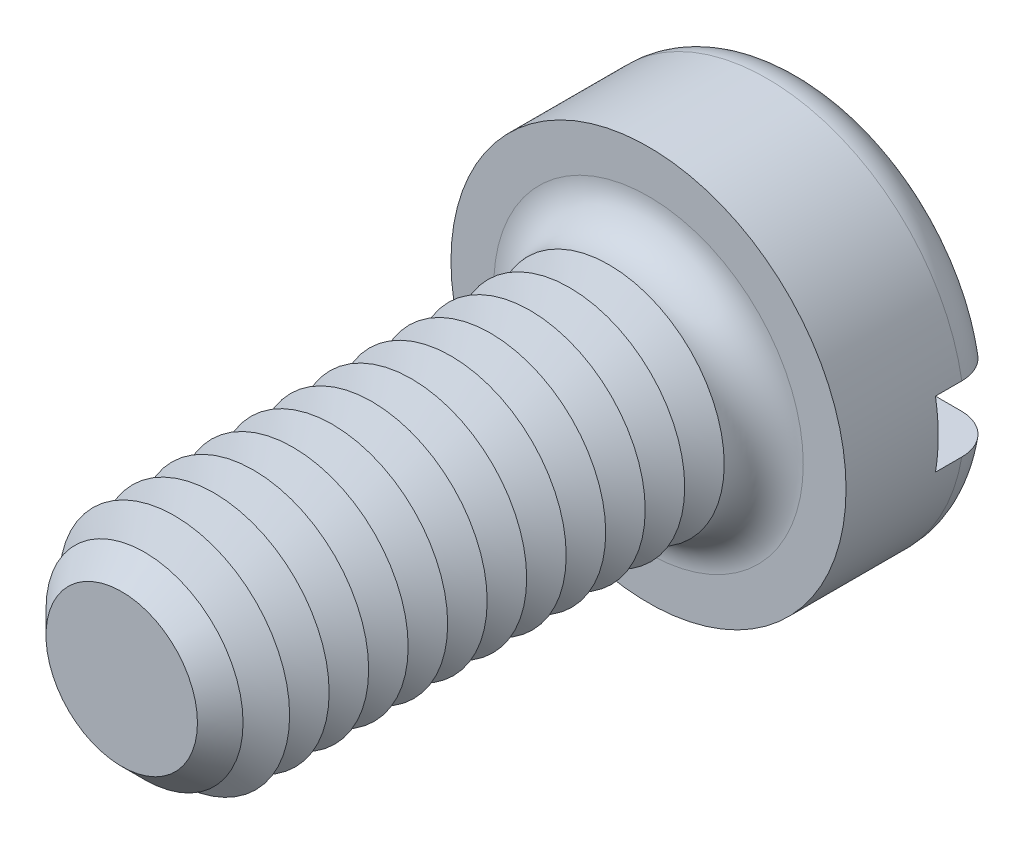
ISO-10303-21;
HEADER;
FILE_DESCRIPTION(('STEP AP214'),'2;1');
FILE_NAME('part.step','',(''),(''),'','','');
FILE_SCHEMA(('AUTOMOTIVE_DESIGN { 1 0 10303 214 1 1 1 1 }'));
ENDSEC;
DATA;
#1=APPLICATION_CONTEXT('core data for automotive mechanical design processes');
#2=APPLICATION_PROTOCOL_DEFINITION('international standard','automotive_design',2000,#1);
#3=PRODUCT_CONTEXT('',#1,'mechanical');
#4=PRODUCT('Part','Part','',(#3));
#5=PRODUCT_RELATED_PRODUCT_CATEGORY('part','',(#4));
#6=PRODUCT_DEFINITION_FORMATION('','',#4);
#7=PRODUCT_DEFINITION_CONTEXT('part definition',#1,'design');
#8=PRODUCT_DEFINITION('design','',#6,#7);
#9=PRODUCT_DEFINITION_SHAPE('','',#8);
#10=(LENGTH_UNIT() NAMED_UNIT(*) SI_UNIT(.MILLI.,.METRE.));
#11=(NAMED_UNIT(*) PLANE_ANGLE_UNIT() SI_UNIT($,.RADIAN.));
#12=(NAMED_UNIT(*) SI_UNIT($,.STERADIAN.) SOLID_ANGLE_UNIT());
#13=UNCERTAINTY_MEASURE_WITH_UNIT(LENGTH_MEASURE(1.E-05),#10,'distance_accuracy_value','');
#14=(GEOMETRIC_REPRESENTATION_CONTEXT(3) GLOBAL_UNCERTAINTY_ASSIGNED_CONTEXT((#13)) GLOBAL_UNIT_ASSIGNED_CONTEXT((#10,
#11,#12)) REPRESENTATION_CONTEXT('',''));
#15=CARTESIAN_POINT('',(0.,0.,0.));
#16=DIRECTION('',(0.,0.,1.));
#17=DIRECTION('',(1.,0.,0.));
#18=AXIS2_PLACEMENT_3D('',#15,#16,#17);
#19=CARTESIAN_POINT('',(0.,0.,-2.4));
#20=DIRECTION('',(0.,0.,1.));
#21=DIRECTION('',(1.,0.,0.));
#22=AXIS2_PLACEMENT_3D('',#19,#20,#21);
#23=PLANE('',#22);
#24=CARTESIAN_POINT('',(0.,0.,-2.4));
#25=DIRECTION('',(0.,0.,1.));
#26=DIRECTION('',(1.,0.,0.));
#27=AXIS2_PLACEMENT_3D('',#24,#25,#26);
#28=CIRCLE('',#27,2.4);
#29=CARTESIAN_POINT('',(-2.3473389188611,0.5,-2.4));
#30=VERTEX_POINT('',#29);
#31=CARTESIAN_POINT('',(2.3473389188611,0.5,-2.4));
#32=VERTEX_POINT('',#31);
#33=EDGE_CURVE('E116',#30,#32,#28,.F.);
#34=ORIENTED_EDGE('',*,*,#33,.T.);
#35=DIRECTION('',(1.,0.,0.));
#36=VECTOR('',#35,1.);
#37=CARTESIAN_POINT('',(-3.,0.5,-2.4));
#38=LINE('',#37,#36);
#39=EDGE_CURVE('E111',#30,#32,#38,.T.);
#40=ORIENTED_EDGE('',*,*,#39,.F.);
#41=EDGE_LOOP('',(#34,#40));
#42=FACE_BOUND('',#41,.T.);
#43=ADVANCED_FACE('F39',(#42),#23,.F.);
#44=CARTESIAN_POINT('',(0.,0.,-1.8));
#45=DIRECTION('',(0.,0.,1.));
#46=DIRECTION('',(1.,0.,0.));
#47=AXIS2_PLACEMENT_3D('',#44,#45,#46);
#48=TOROIDAL_SURFACE('',#47,2.4,0.6);
#49=CARTESIAN_POINT('',(-2.85761641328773,0.5,-2.13010535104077));
#50=CARTESIAN_POINT('',(-2.83871556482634,0.5,-2.1583605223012));
#51=CARTESIAN_POINT('',(-2.81738546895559,0.5,-2.18502342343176));
#52=CARTESIAN_POINT('',(-2.7705148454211,0.5,-2.23439244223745));
#53=CARTESIAN_POINT('',(-2.74496859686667,0.5,-2.25709309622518));
#54=CARTESIAN_POINT('',(-2.6904684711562,0.5,-2.29787524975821));
#55=CARTESIAN_POINT('',(-2.66151863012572,0.5,-2.3159621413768));
#56=CARTESIAN_POINT('',(-2.60103287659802,0.5,-2.34708203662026));
#57=CARTESIAN_POINT('',(-2.56949759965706,0.5,-2.36011627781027));
#58=CARTESIAN_POINT('',(-2.50430694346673,0.5,-2.38095952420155));
#59=CARTESIAN_POINT('',(-2.47062984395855,0.5,-2.38870056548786));
#60=CARTESIAN_POINT('',(-2.40245905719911,0.5,-2.39852415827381));
#61=CARTESIAN_POINT('',(-2.36796525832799,0.5,-2.40060593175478));
#62=CARTESIAN_POINT('',(-2.29850850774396,0.5,-2.39907718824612));
#63=CARTESIAN_POINT('',(-2.2635477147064,0.5,-2.3953679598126));
#64=CARTESIAN_POINT('',(-2.19472542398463,0.5,-2.38219781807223));
#65=CARTESIAN_POINT('',(-2.16086402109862,0.5,-2.37273641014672));
#66=CARTESIAN_POINT('',(-2.09483473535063,0.5,-2.3481926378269));
#67=CARTESIAN_POINT('',(-2.06268841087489,0.5,-2.3330521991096));
#68=CARTESIAN_POINT('',(-2.00140871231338,0.5,-2.29756210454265));
#69=CARTESIAN_POINT('',(-1.97227539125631,0.5,-2.27721235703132));
#70=CARTESIAN_POINT('',(-1.91805676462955,0.5,-2.23196210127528));
#71=CARTESIAN_POINT('',(-1.89294995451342,0.5,-2.20708739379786));
#72=CARTESIAN_POINT('',(-1.84740424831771,0.5,-2.1533758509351));
#73=CARTESIAN_POINT('',(-1.82696468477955,0.5,-2.12453958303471));
#74=CARTESIAN_POINT('',(-1.7919439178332,0.5,-2.06452274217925));
#75=CARTESIAN_POINT('',(-1.7772221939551,0.5,-2.03342424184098));
#76=CARTESIAN_POINT('',(-1.75343025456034,0.5,-1.96913621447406));
#77=CARTESIAN_POINT('',(-1.74435859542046,0.5,-1.93594722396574));
#78=CARTESIAN_POINT('',(-1.73243855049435,0.5,-1.86969199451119));
#79=CARTESIAN_POINT('',(-1.72938008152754,0.5,-1.83666346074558));
#80=CARTESIAN_POINT('',(-1.72896592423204,0.5,-1.77057287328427));
#81=CARTESIAN_POINT('',(-1.73160950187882,0.5,-1.73751082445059));
#82=CARTESIAN_POINT('',(-1.7423966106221,0.5,-1.67291835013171));
#83=CARTESIAN_POINT('',(-1.75043952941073,0.5,-1.64137102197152));
#84=CARTESIAN_POINT('',(-1.77163396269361,0.5,-1.58004446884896));
#85=CARTESIAN_POINT('',(-1.78478577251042,0.5,-1.55026534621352));
#86=CARTESIAN_POINT('',(-1.81598186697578,0.5,-1.49283859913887));
#87=CARTESIAN_POINT('',(-1.83409369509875,0.5,-1.46522772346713));
#88=CARTESIAN_POINT('',(-1.87455179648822,0.5,-1.41330756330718));
#89=CARTESIAN_POINT('',(-1.89689874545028,0.5,-1.38899880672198));
#90=CARTESIAN_POINT('',(-1.94600584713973,0.5,-1.34349499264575));
#91=CARTESIAN_POINT('',(-1.97289034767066,0.5,-1.32243411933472));
#92=CARTESIAN_POINT('',(-2.02972905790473,0.5,-1.28496935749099));
#93=CARTESIAN_POINT('',(-2.05968375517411,0.5,-1.26856621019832));
#94=CARTESIAN_POINT('',(-2.12276894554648,0.5,-1.24040709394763));
#95=CARTESIAN_POINT('',(-2.15596700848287,0.5,-1.22880230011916));
#96=CARTESIAN_POINT('',(-2.22383000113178,0.5,-1.21126311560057));
#97=CARTESIAN_POINT('',(-2.25849504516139,0.5,-1.20532916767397));
#98=CARTESIAN_POINT('',(-2.32870403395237,0.5,-1.1992792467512));
#99=CARTESIAN_POINT('',(-2.36425340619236,0.5,-1.19922586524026));
#100=CARTESIAN_POINT('',(-2.4348506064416,0.5,-1.2051326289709));
#101=CARTESIAN_POINT('',(-2.4698984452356,0.5,-1.21109264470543));
#102=CARTESIAN_POINT('',(-2.53821803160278,0.5,-1.22883658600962));
#103=CARTESIAN_POINT('',(-2.57150081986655,0.5,-1.24057794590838));
#104=CARTESIAN_POINT('',(-2.63557260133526,0.5,-1.2695744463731));
#105=CARTESIAN_POINT('',(-2.66636179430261,0.5,-1.28682914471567));
#106=CARTESIAN_POINT('',(-2.72402406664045,0.5,-1.32606063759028));
#107=CARTESIAN_POINT('',(-2.75095352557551,0.5,-1.34795455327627));
#108=CARTESIAN_POINT('',(-2.80067182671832,0.5,-1.39602603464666));
#109=CARTESIAN_POINT('',(-2.82346106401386,0.5,-1.42220319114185));
#110=CARTESIAN_POINT('',(-2.86383281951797,0.5,-1.47760238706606));
#111=CARTESIAN_POINT('',(-2.88149947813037,0.5,-1.50676312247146));
#112=CARTESIAN_POINT('',(-2.91160874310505,0.5,-1.56766595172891));
#113=CARTESIAN_POINT('',(-2.92405198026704,0.5,-1.59940773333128));
#114=CARTESIAN_POINT('',(-2.94319943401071,0.5,-1.66411282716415));
#115=CARTESIAN_POINT('',(-2.94997843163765,0.5,-1.69705402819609));
#116=CARTESIAN_POINT('',(-2.95787009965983,0.5,-1.7636173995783));
#117=CARTESIAN_POINT('',(-2.95898157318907,0.5,-1.79723971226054));
#118=CARTESIAN_POINT('',(-2.95551354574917,0.5,-1.86397776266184));
#119=CARTESIAN_POINT('',(-2.95096897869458,0.5,-1.89709534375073));
#120=CARTESIAN_POINT('',(-2.93638731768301,0.5,-1.96206785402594));
#121=CARTESIAN_POINT('',(-2.92635713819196,0.5,-1.99392431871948));
#122=CARTESIAN_POINT('',(-2.90618743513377,0.5,-2.04315073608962));
#123=CARTESIAN_POINT('',(-2.89769874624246,0.5,-2.06121519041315));
#124=CARTESIAN_POINT('',(-2.87895753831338,0.5,-2.096404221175));
#125=CARTESIAN_POINT('',(-2.86870503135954,0.5,-2.11352880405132));
#126=CARTESIAN_POINT('',(-2.85761641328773,0.5,-2.13010535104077));
#127=B_SPLINE_CURVE_WITH_KNOTS('',3,(#49,#50,#51,#52,#53,#54,#55,#56,#57,#58,#59,#60,#61,#62,
#63,#64,#65,#66,#67,#68,#69,#70,#71,#72,#73,#74,#75,#76,#77,#78,#79,#80,#81,#82,#83,#84,#85,#86,
#87,#88,#89,#90,#91,#92,#93,#94,#95,#96,#97,#98,#99,#100,#101,#102,#103,#104,#105,#106,#107,
#108,#109,#110,#111,#112,#113,#114,#115,#116,#117,#118,#119,#120,#121,#122,#123,#124,#125,#126),
.UNSPECIFIED.,.T.,.F.,(4,2,2,2,2,2,2,2,2,2,2,2,2,2,2,2,2,2,2,2,2,2,2,2,2,2,2,2,2,2,2,2,2,2,2,2,
2,2,4),(0.,0.101907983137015,0.203955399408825,0.305883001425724,0.407785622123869,
0.510973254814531,0.614175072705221,0.719155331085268,0.824144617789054,0.930238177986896,
1.03633360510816,1.14184204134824,1.24733537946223,1.35004136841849,1.45272110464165,
1.5517448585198,1.65075586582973,1.74797128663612,1.84519232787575,1.9438094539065,
2.0424423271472,2.14443321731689,2.24644032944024,2.35145317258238,2.45647421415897,
2.56261297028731,2.66874944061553,2.77411589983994,2.87947390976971,2.98308820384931,
3.08669260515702,3.18848388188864,3.29026286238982,3.39067588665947,3.49111011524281,
3.59092708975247,3.69061853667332,3.75040561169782,3.81019227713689),.UNSPECIFIED.);
#128=CARTESIAN_POINT('',(-2.95803989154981,0.5,-1.8));
#129=VERTEX_POINT('',#128);
#130=EDGE_CURVE('E280',#129,#30,#127,.T.);
#131=ORIENTED_EDGE('',*,*,#130,.F.);
#132=CARTESIAN_POINT('',(0.,0.,-1.8));
#133=DIRECTION('',(0.,0.,1.));
#134=DIRECTION('',(1.,0.,0.));
#135=AXIS2_PLACEMENT_3D('',#132,#133,#134);
#136=CIRCLE('',#135,3.);
#137=CARTESIAN_POINT('',(2.95803989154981,0.5,-1.8));
#138=VERTEX_POINT('',#137);
#139=EDGE_CURVE('E124',#138,#129,#136,.T.);
#140=ORIENTED_EDGE('',*,*,#139,.F.);
#141=CARTESIAN_POINT('',(1.78664846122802,0.5,-2.05158390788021));
#142=CARTESIAN_POINT('',(1.80142751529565,0.5,-2.08239430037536));
#143=CARTESIAN_POINT('',(1.81889355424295,0.5,-2.111949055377));
#144=CARTESIAN_POINT('',(1.8585933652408,0.5,-2.16770384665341));
#145=CARTESIAN_POINT('',(1.88083491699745,0.5,-2.19389829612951));
#146=CARTESIAN_POINT('',(1.92931942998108,0.5,-2.24217519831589));
#147=CARTESIAN_POINT('',(1.95555471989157,0.5,-2.26426535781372));
#148=CARTESIAN_POINT('',(2.01127789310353,0.5,-2.30384045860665));
#149=CARTESIAN_POINT('',(2.04076488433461,0.5,-2.32132665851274));
#150=CARTESIAN_POINT('',(2.10290022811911,0.5,-2.3516259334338));
#151=CARTESIAN_POINT('',(2.13560600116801,0.5,-2.3643213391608));
#152=CARTESIAN_POINT('',(2.20267136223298,0.5,-2.38412242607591));
#153=CARTESIAN_POINT('',(2.23703118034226,0.5,-2.3912273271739));
#154=CARTESIAN_POINT('',(2.30690186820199,0.5,-2.39969404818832));
#155=CARTESIAN_POINT('',(2.34242185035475,0.5,-2.40098100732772));
#156=CARTESIAN_POINT('',(2.41317063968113,0.5,-2.39753827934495));
#157=CARTESIAN_POINT('',(2.44839945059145,0.5,-2.39280866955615));
#158=CARTESIAN_POINT('',(2.51734146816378,0.5,-2.37746773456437));
#159=CARTESIAN_POINT('',(2.55106223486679,0.5,-2.3668904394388));
#160=CARTESIAN_POINT('',(2.61620389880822,0.5,-2.34013333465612));
#161=CARTESIAN_POINT('',(2.64762498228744,0.5,-2.32395397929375));
#162=CARTESIAN_POINT('',(2.70673284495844,0.5,-2.28672393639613));
#163=CARTESIAN_POINT('',(2.73447138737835,0.5,-2.26575544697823));
#164=CARTESIAN_POINT('',(2.78595339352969,0.5,-2.21938197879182));
#165=CARTESIAN_POINT('',(2.80969724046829,0.5,-2.19397742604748));
#166=CARTESIAN_POINT('',(2.85207235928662,0.5,-2.13993965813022));
#167=CARTESIAN_POINT('',(2.87078674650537,0.5,-2.11137160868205));
#168=CARTESIAN_POINT('',(2.90307455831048,0.5,-2.05146448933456));
#169=CARTESIAN_POINT('',(2.91664841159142,0.5,-2.02012565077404));
#170=CARTESIAN_POINT('',(2.93808283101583,0.5,-1.95603682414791));
#171=CARTESIAN_POINT('',(2.94602016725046,0.5,-1.92331249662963));
#172=CARTESIAN_POINT('',(2.95624273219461,0.5,-1.85699296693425));
#173=CARTESIAN_POINT('',(2.95852824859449,0.5,-1.82339780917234));
#174=CARTESIAN_POINT('',(2.95738171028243,0.5,-1.75655451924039));
#175=CARTESIAN_POINT('',(2.95399174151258,0.5,-1.72330565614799));
#176=CARTESIAN_POINT('',(2.94167749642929,0.5,-1.65784996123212));
#177=CARTESIAN_POINT('',(2.93275329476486,0.5,-1.62564311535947));
#178=CARTESIAN_POINT('',(2.90963870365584,0.5,-1.56317641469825));
#179=CARTESIAN_POINT('',(2.89544787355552,0.5,-1.53291672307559));
#180=CARTESIAN_POINT('',(2.86222325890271,0.5,-1.47518589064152));
#181=CARTESIAN_POINT('',(2.84318935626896,0.5,-1.44771481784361));
#182=CARTESIAN_POINT('',(2.80067851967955,0.5,-1.39611362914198));
#183=CARTESIAN_POINT('',(2.77716960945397,0.5,-1.37200986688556));
#184=CARTESIAN_POINT('',(2.72648704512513,0.5,-1.3280274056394));
#185=CARTESIAN_POINT('',(2.69931317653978,0.5,-1.3081489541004));
#186=CARTESIAN_POINT('',(2.64167967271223,0.5,-1.27288334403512));
#187=CARTESIAN_POINT('',(2.61118015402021,0.5,-1.25756138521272));
#188=CARTESIAN_POINT('',(2.54807315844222,0.5,-1.2321564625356));
#189=CARTESIAN_POINT('',(2.51546550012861,0.5,-1.22207395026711));
#190=CARTESIAN_POINT('',(2.44846246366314,0.5,-1.20724783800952));
#191=CARTESIAN_POINT('',(2.41404584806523,0.5,-1.2026002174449));
#192=CARTESIAN_POINT('',(2.34491756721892,0.5,-1.19904907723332));
#193=CARTESIAN_POINT('',(2.3102058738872,0.5,-1.20014611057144));
#194=CARTESIAN_POINT('',(2.24087507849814,0.5,-1.20808958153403));
#195=CARTESIAN_POINT('',(2.20626660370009,0.5,-1.21502895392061));
#196=CARTESIAN_POINT('',(2.13868705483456,0.5,-1.23457616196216));
#197=CARTESIAN_POINT('',(2.10571611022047,0.5,-1.24718444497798));
#198=CARTESIAN_POINT('',(2.04212010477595,0.5,-1.2778419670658));
#199=CARTESIAN_POINT('',(2.0115131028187,0.5,-1.29592871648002));
#200=CARTESIAN_POINT('',(1.95381117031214,0.5,-1.33703838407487));
#201=CARTESIAN_POINT('',(1.92671618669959,0.5,-1.36006122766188));
#202=CARTESIAN_POINT('',(1.8771749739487,0.5,-1.41014760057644));
#203=CARTESIAN_POINT('',(1.85467966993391,0.5,-1.43716252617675));
#204=CARTESIAN_POINT('',(1.8147167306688,0.5,-1.49468601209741));
#205=CARTESIAN_POINT('',(1.79724791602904,0.5,-1.52519375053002));
#206=CARTESIAN_POINT('',(1.76843420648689,0.5,-1.58782676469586));
#207=CARTESIAN_POINT('',(1.75691546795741,0.5,-1.61987202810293));
#208=CARTESIAN_POINT('',(1.73963101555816,0.5,-1.68548715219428));
#209=CARTESIAN_POINT('',(1.73386545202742,0.5,-1.71905705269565));
#210=CARTESIAN_POINT('',(1.72840927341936,0.5,-1.78556262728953));
#211=CARTESIAN_POINT('',(1.72852416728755,0.5,-1.8184825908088));
#212=CARTESIAN_POINT('',(1.73434422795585,0.5,-1.88379362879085));
#213=CARTESIAN_POINT('',(1.74004181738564,0.5,-1.91618535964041));
#214=CARTESIAN_POINT('',(1.75312909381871,0.5,-1.96568884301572));
#215=CARTESIAN_POINT('',(1.75869685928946,0.5,-1.98330302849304));
#216=CARTESIAN_POINT('',(1.77146455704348,0.5,-2.01792824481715));
#217=CARTESIAN_POINT('',(1.7786644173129,0.5,-2.03493930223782));
#218=CARTESIAN_POINT('',(1.78664846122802,0.5,-2.05158390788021));
#219=B_SPLINE_CURVE_WITH_KNOTS('',3,(#141,#142,#143,#144,#145,#146,#147,#148,#149,#150,#151,
#152,#153,#154,#155,#156,#157,#158,#159,#160,#161,#162,#163,#164,#165,#166,#167,#168,#169,#170,
#171,#172,#173,#174,#175,#176,#177,#178,#179,#180,#181,#182,#183,#184,#185,#186,#187,#188,#189,
#190,#191,#192,#193,#194,#195,#196,#197,#198,#199,#200,#201,#202,#203,#204,#205,#206,#207,#208,
#209,#210,#211,#212,#213,#214,#215,#216,#217,#218),.UNSPECIFIED.,.T.,.F.,(4,2,2,2,2,2,2,2,2,2,2,
2,2,2,2,2,2,2,2,2,2,2,2,2,2,2,2,2,2,2,2,2,2,2,2,2,2,2,4),(0.,0.10244464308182,0.205057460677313,
0.307475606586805,0.409865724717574,0.514628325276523,0.619405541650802,0.72552718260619,
0.831647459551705,0.937156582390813,1.04265715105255,1.1464674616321,1.25026780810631,
1.3522293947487,1.45418247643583,1.55471883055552,1.6552500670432,1.75503912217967,
1.8548268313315,1.95462289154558,2.05442138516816,2.15496174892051,2.25550799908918,
2.35743049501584,2.45936177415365,2.56306719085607,2.66678259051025,2.77217967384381,
2.87758507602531,2.98372914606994,3.08987161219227,3.19481457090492,3.29973288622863,
3.40138228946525,3.50303434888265,3.60132659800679,3.69948562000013,3.75483142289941,
3.8101747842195),.UNSPECIFIED.);
#220=EDGE_CURVE('E282',#32,#138,#219,.T.);
#221=ORIENTED_EDGE('',*,*,#220,.F.);
#222=ORIENTED_EDGE('',*,*,#33,.F.);
#223=EDGE_LOOP('',(#131,#140,#221,#222));
#224=FACE_BOUND('',#223,.T.);
#225=ADVANCED_FACE('F264',(#224),#48,.T.);
#226=CARTESIAN_POINT('',(0.,0.,-2.4));
#227=DIRECTION('',(0.,0.,1.));
#228=DIRECTION('',(1.,0.,0.));
#229=AXIS2_PLACEMENT_3D('',#226,#227,#228);
#230=CYLINDRICAL_SURFACE('',#229,3.);
#231=DIRECTION('',(0.,0.,1.));
#232=VECTOR('',#231,1.);
#233=CARTESIAN_POINT('',(2.95803989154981,0.5,-2.4));
#234=LINE('',#233,#232);
#235=CARTESIAN_POINT('',(2.95803989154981,0.5,-1.4));
#236=VERTEX_POINT('',#235);
#237=EDGE_CURVE('E296',#138,#236,#234,.T.);
#238=ORIENTED_EDGE('',*,*,#237,.F.);
#239=ORIENTED_EDGE('',*,*,#139,.T.);
#240=DIRECTION('',(0.,0.,1.));
#241=VECTOR('',#240,1.);
#242=CARTESIAN_POINT('',(-2.95803989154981,0.5,-2.4));
#243=LINE('',#242,#241);
#244=CARTESIAN_POINT('',(-2.95803989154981,0.5,-1.4));
#245=VERTEX_POINT('',#244);
#246=EDGE_CURVE('E63',#245,#129,#243,.F.);
#247=ORIENTED_EDGE('',*,*,#246,.F.);
#248=CARTESIAN_POINT('',(0.,0.,-1.4));
#249=DIRECTION('',(0.,0.,-1.));
#250=DIRECTION('',(-1.,0.,0.));
#251=AXIS2_PLACEMENT_3D('',#248,#249,#250);
#252=CIRCLE('',#251,3.);
#253=CARTESIAN_POINT('',(-2.95803989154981,-0.5,-1.4));
#254=VERTEX_POINT('',#253);
#255=EDGE_CURVE('E43',#245,#254,#252,.F.);
#256=ORIENTED_EDGE('',*,*,#255,.T.);
#257=DIRECTION('',(0.,0.,1.));
#258=VECTOR('',#257,1.);
#259=CARTESIAN_POINT('',(-2.95803989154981,-0.5,-2.4));
#260=LINE('',#259,#258);
#261=CARTESIAN_POINT('',(-2.9580398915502,-0.5,-1.79999999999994));
#262=VERTEX_POINT('',#261);
#263=EDGE_CURVE('E293',#262,#254,#260,.T.);
#264=ORIENTED_EDGE('',*,*,#263,.F.);
#265=CARTESIAN_POINT('',(2.95803989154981,-0.5,-1.8));
#266=VERTEX_POINT('',#265);
#267=EDGE_CURVE('E126',#262,#266,#136,.T.);
#268=ORIENTED_EDGE('',*,*,#267,.T.);
#269=DIRECTION('',(0.,0.,1.));
#270=VECTOR('',#269,1.);
#271=CARTESIAN_POINT('',(2.95803989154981,-0.5,-2.4));
#272=LINE('',#271,#270);
#273=CARTESIAN_POINT('',(2.95803989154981,-0.5,-1.4));
#274=VERTEX_POINT('',#273);
#275=EDGE_CURVE('E55',#274,#266,#272,.F.);
#276=ORIENTED_EDGE('',*,*,#275,.F.);
#277=EDGE_CURVE('E11',#274,#236,#252,.F.);
#278=ORIENTED_EDGE('',*,*,#277,.T.);
#279=EDGE_LOOP('',(#238,#239,#247,#256,#264,#268,#276,#278));
#280=FACE_BOUND('',#279,.T.);
#281=CARTESIAN_POINT('',(0.,0.,0.));
#282=DIRECTION('',(0.,0.,1.));
#283=DIRECTION('',(1.,0.,0.));
#284=AXIS2_PLACEMENT_3D('',#281,#282,#283);
#285=CIRCLE('',#284,3.);
#286=CARTESIAN_POINT('',(3.,0.,0.));
#287=VERTEX_POINT('',#286);
#288=EDGE_CURVE('E299',#287,#287,#285,.T.);
#289=ORIENTED_EDGE('',*,*,#288,.F.);
#290=EDGE_LOOP('',(#289));
#291=FACE_BOUND('',#290,.T.);
#292=ADVANCED_FACE('F260',(#280,#291),#230,.T.);
#293=CARTESIAN_POINT('',(2.3473389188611,-0.5,-2.4));
#294=VERTEX_POINT('',#293);
#295=CARTESIAN_POINT('',(-2.3473389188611,-0.5,-2.4));
#296=VERTEX_POINT('',#295);
#297=EDGE_CURVE('E109',#294,#296,#28,.F.);
#298=ORIENTED_EDGE('',*,*,#297,.T.);
#299=DIRECTION('',(-1.,0.,0.));
#300=VECTOR('',#299,1.);
#301=CARTESIAN_POINT('',(-3.,-0.5,-2.4));
#302=LINE('',#301,#300);
#303=EDGE_CURVE('E96',#294,#296,#302,.T.);
#304=ORIENTED_EDGE('',*,*,#303,.F.);
#305=EDGE_LOOP('',(#298,#304));
#306=FACE_BOUND('',#305,.T.);
#307=ADVANCED_FACE('F108',(#306),#23,.F.);
#308=CARTESIAN_POINT('',(0.,0.,0.));
#309=DIRECTION('',(0.,0.,1.));
#310=DIRECTION('',(1.,0.,0.));
#311=AXIS2_PLACEMENT_3D('',#308,#309,#310);
#312=PLANE('',#311);
#313=CARTESIAN_POINT('',(0.,0.,0.));
#314=DIRECTION('',(0.,0.,1.));
#315=DIRECTION('',(1.,0.,0.));
#316=AXIS2_PLACEMENT_3D('',#313,#314,#315);
#317=CIRCLE('',#316,2.35);
#318=CARTESIAN_POINT('',(2.35,0.,0.));
#319=VERTEX_POINT('',#318);
#320=EDGE_CURVE('E115',#319,#319,#317,.F.);
#321=ORIENTED_EDGE('',*,*,#320,.T.);
#322=EDGE_LOOP('',(#321));
#323=FACE_BOUND('',#322,.T.);
#324=ORIENTED_EDGE('',*,*,#288,.T.);
#325=EDGE_LOOP('',(#324));
#326=FACE_BOUND('',#325,.T.);
#327=ADVANCED_FACE('F259',(#323,#326),#312,.T.);
#328=CARTESIAN_POINT('',(-2.85761641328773,-0.5,-2.13010535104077));
#329=CARTESIAN_POINT('',(-2.87617085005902,-0.5,-2.10236255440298));
#330=CARTESIAN_POINT('',(-2.89241094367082,-0.5,-2.07304478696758));
#331=CARTESIAN_POINT('',(-2.91975805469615,-0.5,-2.01207835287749));
#332=CARTESIAN_POINT('',(-2.93085958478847,-0.5,-1.98042723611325));
#333=CARTESIAN_POINT('',(-2.94757590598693,-0.5,-1.91570997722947));
#334=CARTESIAN_POINT('',(-2.95319165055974,-0.5,-1.88264408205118));
#335=CARTESIAN_POINT('',(-2.95876526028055,-0.5,-1.81604673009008));
#336=CARTESIAN_POINT('',(-2.95872441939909,-0.5,-1.78251538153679));
#337=CARTESIAN_POINT('',(-2.95300126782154,-0.5,-1.71606888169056));
#338=CARTESIAN_POINT('',(-2.94734076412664,-0.5,-1.68315184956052));
#339=CARTESIAN_POINT('',(-2.93058183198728,-0.5,-1.61873244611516));
#340=CARTESIAN_POINT('',(-2.91948325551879,-0.5,-1.58723011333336));
#341=CARTESIAN_POINT('',(-2.89215903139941,-0.5,-1.52647404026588));
#342=CARTESIAN_POINT('',(-2.87592518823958,-0.5,-1.49722398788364));
#343=CARTESIAN_POINT('',(-2.83881787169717,-0.5,-1.44183365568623));
#344=CARTESIAN_POINT('',(-2.81794425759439,-0.5,-1.41569347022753));
#345=CARTESIAN_POINT('',(-2.77196258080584,-0.5,-1.36700890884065));
#346=CARTESIAN_POINT('',(-2.74681874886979,-0.5,-1.34449832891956));
#347=CARTESIAN_POINT('',(-2.69315595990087,-0.5,-1.30394571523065));
#348=CARTESIAN_POINT('',(-2.66463678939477,-0.5,-1.28590396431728));
#349=CARTESIAN_POINT('',(-2.6045885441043,-0.5,-1.25451133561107));
#350=CARTESIAN_POINT('',(-2.573021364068,-0.5,-1.24123336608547));
#351=CARTESIAN_POINT('',(-2.50813094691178,-0.5,-1.22006271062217));
#352=CARTESIAN_POINT('',(-2.47480755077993,-0.5,-1.21217051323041));
#353=CARTESIAN_POINT('',(-2.40672281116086,-0.5,-1.20185046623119));
#354=CARTESIAN_POINT('',(-2.37194646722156,-0.5,-1.19952155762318));
#355=CARTESIAN_POINT('',(-2.30248663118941,-0.5,-1.20064178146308));
#356=CARTESIAN_POINT('',(-2.26780314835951,-0.5,-1.20409147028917));
#357=CARTESIAN_POINT('',(-2.19896003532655,-0.5,-1.21674803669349));
#358=CARTESIAN_POINT('',(-2.16481620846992,-0.5,-1.22604100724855));
#359=CARTESIAN_POINT('',(-2.09855902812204,-0.5,-1.25020237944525));
#360=CARTESIAN_POINT('',(-2.0664458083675,-0.5,-1.2650711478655));
#361=CARTESIAN_POINT('',(-2.00504979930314,-0.5,-1.3000633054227));
#362=CARTESIAN_POINT('',(-1.97577870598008,-0.5,-1.32020724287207));
#363=CARTESIAN_POINT('',(-1.92109882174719,-0.5,-1.36519538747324));
#364=CARTESIAN_POINT('',(-1.89568984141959,-0.5,-1.39003936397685));
#365=CARTESIAN_POINT('',(-1.84992350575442,-0.5,-1.44333696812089));
#366=CARTESIAN_POINT('',(-1.82949305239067,-0.5,-1.47172774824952));
#367=CARTESIAN_POINT('',(-1.79388305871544,-0.5,-1.53163225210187));
#368=CARTESIAN_POINT('',(-1.77870235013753,-0.5,-1.56314527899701));
#369=CARTESIAN_POINT('',(-1.7545759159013,-0.5,-1.62726698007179));
#370=CARTESIAN_POINT('',(-1.74543784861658,-0.5,-1.65980327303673));
#371=CARTESIAN_POINT('',(-1.73294830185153,-0.5,-1.72596654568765));
#372=CARTESIAN_POINT('',(-1.72959555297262,-0.5,-1.7595932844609));
#373=CARTESIAN_POINT('',(-1.72881879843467,-0.5,-1.82588200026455));
#374=CARTESIAN_POINT('',(-1.73121660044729,-0.5,-1.85854202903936));
#375=CARTESIAN_POINT('',(-1.74148022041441,-0.5,-1.9229888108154));
#376=CARTESIAN_POINT('',(-1.74934586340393,-0.5,-1.95477559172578));
#377=CARTESIAN_POINT('',(-1.77023164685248,-0.5,-2.01650910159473));
#378=CARTESIAN_POINT('',(-1.78323812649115,-0.5,-2.04646046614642));
#379=CARTESIAN_POINT('',(-1.81396733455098,-0.5,-2.10383471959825));
#380=CARTESIAN_POINT('',(-1.83169061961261,-0.5,-2.13125730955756));
#381=CARTESIAN_POINT('',(-1.87183626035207,-0.5,-2.18359240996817));
#382=CARTESIAN_POINT('',(-1.89437158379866,-0.5,-2.20841820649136));
#383=CARTESIAN_POINT('',(-1.9431646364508,-0.5,-2.25409214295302));
#384=CARTESIAN_POINT('',(-1.96942301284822,-0.5,-2.27493958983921));
#385=CARTESIAN_POINT('',(-2.025898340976,-0.5,-2.31281042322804));
#386=CARTESIAN_POINT('',(-2.05622082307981,-0.5,-2.32967654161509));
#387=CARTESIAN_POINT('',(-2.11922391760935,-0.5,-2.35820255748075));
#388=CARTESIAN_POINT('',(-2.15190483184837,-0.5,-2.3698617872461));
#389=CARTESIAN_POINT('',(-2.21944675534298,-0.5,-2.38785911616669));
#390=CARTESIAN_POINT('',(-2.25433929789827,-0.5,-2.39407914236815));
#391=CARTESIAN_POINT('',(-2.32467357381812,-0.5,-2.40058243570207));
#392=CARTESIAN_POINT('',(-2.36011530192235,-0.5,-2.40086575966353));
#393=CARTESIAN_POINT('',(-2.43058129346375,-0.5,-2.39545061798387));
#394=CARTESIAN_POINT('',(-2.46560504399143,-0.5,-2.38974544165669));
#395=CARTESIAN_POINT('',(-2.53418188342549,-0.5,-2.37245602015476));
#396=CARTESIAN_POINT('',(-2.56773468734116,-0.5,-2.36087064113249));
#397=CARTESIAN_POINT('',(-2.63195003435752,-0.5,-2.33229154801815));
#398=CARTESIAN_POINT('',(-2.66264330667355,-0.5,-2.31536681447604));
#399=CARTESIAN_POINT('',(-2.72065333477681,-0.5,-2.2765252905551));
#400=CARTESIAN_POINT('',(-2.7479744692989,-0.5,-2.25461508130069));
#401=CARTESIAN_POINT('',(-2.78903570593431,-0.5,-2.21539504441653));
#402=CARTESIAN_POINT('',(-2.80405150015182,-0.5,-2.19939833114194));
#403=CARTESIAN_POINT('',(-2.83224965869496,-0.5,-2.16586257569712));
#404=CARTESIAN_POINT('',(-2.84543204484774,-0.5,-2.14832355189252));
#405=CARTESIAN_POINT('',(-2.85761641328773,-0.5,-2.13010535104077));
#406=B_SPLINE_CURVE_WITH_KNOTS('',3,(#328,#329,#330,#331,#332,#333,#334,#335,#336,#337,#338,
#339,#340,#341,#342,#343,#344,#345,#346,#347,#348,#349,#350,#351,#352,#353,#354,#355,#356,#357,
#358,#359,#360,#361,#362,#363,#364,#365,#366,#367,#368,#369,#370,#371,#372,#373,#374,#375,#376,
#377,#378,#379,#380,#381,#382,#383,#384,#385,#386,#387,#388,#389,#390,#391,#392,#393,#394,#395,
#396,#397,#398,#399,#400,#401,#402,#403,#404,#405),.UNSPECIFIED.,.T.,.F.,(4,2,2,2,2,2,2,2,2,2,2,
2,2,2,2,2,2,2,2,2,2,2,2,2,2,2,2,2,2,2,2,2,2,2,2,2,2,2,4),(0.,0.100047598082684,
0.200201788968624,0.300338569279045,0.400452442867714,0.500179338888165,0.599908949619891,
0.699798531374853,0.799691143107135,0.900465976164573,1.00124718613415,1.10351091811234,
1.20578392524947,1.30986270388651,1.41395150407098,1.51961105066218,1.62527754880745,
1.73136193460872,1.83744111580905,1.94185359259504,2.04624281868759,2.1471248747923,
2.24798479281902,2.34575994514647,2.44353196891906,2.541045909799,2.63857136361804,
2.73870431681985,2.83885469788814,2.94247024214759,3.0460990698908,3.15192527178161,
3.25775046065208,3.36369436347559,3.46965870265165,3.57430655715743,3.67881706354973,
3.74451732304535,3.81021680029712),.UNSPECIFIED.);
#407=EDGE_CURVE('E103',#296,#262,#406,.T.);
#408=ORIENTED_EDGE('',*,*,#407,.F.);
#409=ORIENTED_EDGE('',*,*,#297,.F.);
#410=CARTESIAN_POINT('',(1.78664846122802,-0.5,-2.05158390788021));
#411=CARTESIAN_POINT('',(1.77253256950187,-0.5,-2.02214917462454));
#412=CARTESIAN_POINT('',(1.76084795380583,-0.5,-1.99152692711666));
#413=CARTESIAN_POINT('',(1.74276267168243,-0.5,-1.92873811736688));
#414=CARTESIAN_POINT('',(1.73636622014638,-0.5,-1.89657034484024));
#415=CARTESIAN_POINT('',(1.72910271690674,-0.5,-1.83160458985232));
#416=CARTESIAN_POINT('',(1.72823699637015,-0.5,-1.79880645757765));
#417=CARTESIAN_POINT('',(1.73207277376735,-0.5,-1.73354460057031));
#418=CARTESIAN_POINT('',(1.7367732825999,-0.5,-1.70108081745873));
#419=CARTESIAN_POINT('',(1.75151033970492,-0.5,-1.63763571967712));
#420=CARTESIAN_POINT('',(1.76150868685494,-0.5,-1.60664550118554));
#421=CARTESIAN_POINT('',(1.78646773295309,-0.5,-1.54673433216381));
#422=CARTESIAN_POINT('',(1.80142897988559,-0.5,-1.51781361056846));
#423=CARTESIAN_POINT('',(1.8361687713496,-0.5,-1.46223275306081));
#424=CARTESIAN_POINT('',(1.85603637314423,-0.5,-1.43562834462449));
#425=CARTESIAN_POINT('',(1.89981598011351,-0.5,-1.38598822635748));
#426=CARTESIAN_POINT('',(1.92372865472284,-0.5,-1.3629531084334));
#427=CARTESIAN_POINT('',(1.97581791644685,-0.5,-1.32025912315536));
#428=CARTESIAN_POINT('',(2.00411431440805,-0.5,-1.30074638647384));
#429=CARTESIAN_POINT('',(2.06351340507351,-0.5,-1.26660223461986));
#430=CARTESIAN_POINT('',(2.09461651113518,-0.5,-1.2519715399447));
#431=CARTESIAN_POINT('',(2.15964055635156,-0.5,-1.22763649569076));
#432=CARTESIAN_POINT('',(2.19361437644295,-0.5,-1.21807321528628));
#433=CARTESIAN_POINT('',(2.26268197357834,-0.5,-1.20474094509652));
#434=CARTESIAN_POINT('',(2.29777581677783,-0.5,-1.20097229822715));
#435=CARTESIAN_POINT('',(2.36834397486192,-0.5,-1.19935270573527));
#436=CARTESIAN_POINT('',(2.40381924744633,-0.5,-1.20154258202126));
#437=CARTESIAN_POINT('',(2.47388621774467,-0.5,-1.211906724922));
#438=CARTESIAN_POINT('',(2.50847794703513,-0.5,-1.22008077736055));
#439=CARTESIAN_POINT('',(2.57542869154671,-0.5,-1.24211740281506));
#440=CARTESIAN_POINT('',(2.60780612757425,-0.5,-1.25592395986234));
#441=CARTESIAN_POINT('',(2.66972487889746,-0.5,-1.28886991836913));
#442=CARTESIAN_POINT('',(2.69926644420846,-0.5,-1.3080088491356));
#443=CARTESIAN_POINT('',(2.75412764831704,-0.5,-1.35072337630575));
#444=CARTESIAN_POINT('',(2.77951140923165,-0.5,-1.37421661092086));
#445=CARTESIAN_POINT('',(2.82588981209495,-0.5,-1.42519687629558));
#446=CARTESIAN_POINT('',(2.84688487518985,-0.5,-1.4526835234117));
#447=CARTESIAN_POINT('',(2.88351678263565,-0.5,-1.51036368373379));
#448=CARTESIAN_POINT('',(2.89923879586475,-0.5,-1.54050312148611));
#449=CARTESIAN_POINT('',(2.92532780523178,-0.5,-1.60301687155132));
#450=CARTESIAN_POINT('',(2.93569520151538,-0.5,-1.63539101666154));
#451=CARTESIAN_POINT('',(2.95066155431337,-0.5,-1.70102985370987));
#452=CARTESIAN_POINT('',(2.95532930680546,-0.5,-1.73427887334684));
#453=CARTESIAN_POINT('',(2.9589838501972,-0.5,-1.80108716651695));
#454=CARTESIAN_POINT('',(2.95797087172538,-0.5,-1.83464642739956));
#455=CARTESIAN_POINT('',(2.9503157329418,-0.5,-1.90093629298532));
#456=CARTESIAN_POINT('',(2.9437032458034,-0.5,-1.93367033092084));
#457=CARTESIAN_POINT('',(2.92508830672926,-0.5,-1.99756717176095));
#458=CARTESIAN_POINT('',(2.91308586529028,-0.5,-2.02872997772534));
#459=CARTESIAN_POINT('',(2.88401713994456,-0.5,-2.08868263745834));
#460=CARTESIAN_POINT('',(2.86693946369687,-0.5,-2.11746696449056));
#461=CARTESIAN_POINT('',(2.82823635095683,-0.5,-2.17179415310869));
#462=CARTESIAN_POINT('',(2.80661076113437,-0.5,-2.19733690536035));
#463=CARTESIAN_POINT('',(2.75921750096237,-0.5,-2.24472182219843));
#464=CARTESIAN_POINT('',(2.73341278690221,-0.5,-2.26652692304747));
#465=CARTESIAN_POINT('',(2.67855512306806,-0.5,-2.30557116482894));
#466=CARTESIAN_POINT('',(2.64950194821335,-0.5,-2.32280998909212));
#467=CARTESIAN_POINT('',(2.58850670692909,-0.5,-2.35251615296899));
#468=CARTESIAN_POINT('',(2.55652763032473,-0.5,-2.36490748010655));
#469=CARTESIAN_POINT('',(2.4909651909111,-0.5,-2.38424946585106));
#470=CARTESIAN_POINT('',(2.45738167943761,-0.5,-2.39119961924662));
#471=CARTESIAN_POINT('',(2.38892891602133,-0.5,-2.39958830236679));
#472=CARTESIAN_POINT('',(2.35404742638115,-0.5,-2.40092701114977));
#473=CARTESIAN_POINT('',(2.28454389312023,-0.5,-2.39781917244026));
#474=CARTESIAN_POINT('',(2.24992186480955,-0.5,-2.39337228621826));
#475=CARTESIAN_POINT('',(2.18139250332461,-0.5,-2.37872879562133));
#476=CARTESIAN_POINT('',(2.14750264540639,-0.5,-2.36845030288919));
#477=CARTESIAN_POINT('',(2.08190943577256,-0.5,-2.34236291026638));
#478=CARTESIAN_POINT('',(2.05020675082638,-0.5,-2.32655233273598));
#479=CARTESIAN_POINT('',(1.98982495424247,-0.5,-2.28976285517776));
#480=CARTESIAN_POINT('',(1.96115527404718,-0.5,-2.26876847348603));
#481=CARTESIAN_POINT('',(1.90785147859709,-0.5,-2.22220002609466));
#482=CARTESIAN_POINT('',(1.88321231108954,-0.5,-2.19663177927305));
#483=CARTESIAN_POINT('',(1.84638483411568,-0.5,-2.15106161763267));
#484=CARTESIAN_POINT('',(1.8328227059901,-0.5,-2.13215328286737));
#485=CARTESIAN_POINT('',(1.80797918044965,-0.5,-2.09289185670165));
#486=CARTESIAN_POINT('',(1.79669771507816,-0.5,-2.07253880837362));
#487=CARTESIAN_POINT('',(1.78664846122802,-0.5,-2.05158390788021));
#488=B_SPLINE_CURVE_WITH_KNOTS('',3,(#410,#411,#412,#413,#414,#415,#416,#417,#418,#419,#420,
#421,#422,#423,#424,#425,#426,#427,#428,#429,#430,#431,#432,#433,#434,#435,#436,#437,#438,#439,
#440,#441,#442,#443,#444,#445,#446,#447,#448,#449,#450,#451,#452,#453,#454,#455,#456,#457,#458,
#459,#460,#461,#462,#463,#464,#465,#466,#467,#468,#469,#470,#471,#472,#473,#474,#475,#476,#477,
#478,#479,#480,#481,#482,#483,#484,#485,#486,#487),.UNSPECIFIED.,.T.,.F.,(4,2,2,2,2,2,2,2,2,2,2,
2,2,2,2,2,2,2,2,2,2,2,2,2,2,2,2,2,2,2,2,2,2,2,2,2,2,2,4),(0.,0.0978512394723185,0.19578039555,
0.293733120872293,0.391668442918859,0.488907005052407,0.58615630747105,0.685320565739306,
0.784501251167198,0.887148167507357,0.989810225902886,1.09519726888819,1.20059054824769,
1.30670769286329,1.41282103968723,1.51790384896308,1.62297738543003,1.72623563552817,
1.82948397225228,1.93097382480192,2.03245609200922,2.13270093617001,2.23294171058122,
2.33265458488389,2.43236726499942,2.53230548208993,2.63224706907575,2.73312861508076,
2.83401715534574,2.93642973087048,3.03885181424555,3.14308833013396,3.24733094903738,
3.35307493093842,3.45885100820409,3.56494689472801,3.67090875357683,3.74057217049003,
3.81023351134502),.UNSPECIFIED.);
#489=EDGE_CURVE('E92',#266,#294,#488,.T.);
#490=ORIENTED_EDGE('',*,*,#489,.F.);
#491=ORIENTED_EDGE('',*,*,#267,.F.);
#492=EDGE_LOOP('',(#408,#409,#490,#491));
#493=FACE_BOUND('',#492,.T.);
#494=ADVANCED_FACE('F113',(#493),#48,.T.);
#495=CARTESIAN_POINT('',(0.,0.,0.6));
#496=DIRECTION('',(0.,0.,1.));
#497=DIRECTION('',(1.,0.,0.));
#498=AXIS2_PLACEMENT_3D('',#495,#496,#497);
#499=TOROIDAL_SURFACE('',#498,2.35,0.6);
#500=ORIENTED_EDGE('',*,*,#320,.F.);
#501=EDGE_LOOP('',(#500));
#502=FACE_BOUND('',#501,.T.);
#503=CARTESIAN_POINT('',(0.,0.,0.6));
#504=DIRECTION('',(0.,0.,-1.));
#505=DIRECTION('',(-1.,0.,0.));
#506=AXIS2_PLACEMENT_3D('',#503,#504,#505);
#507=CIRCLE('',#506,1.75);
#508=CARTESIAN_POINT('',(-1.75,0.,0.6));
#509=VERTEX_POINT('',#508);
#510=EDGE_CURVE('E305',#509,#509,#507,.T.);
#511=ORIENTED_EDGE('',*,*,#510,.T.);
#512=EDGE_LOOP('',(#511));
#513=FACE_BOUND('',#512,.T.);
#514=ADVANCED_FACE('F252',(#502,#513),#499,.F.);
#515=CARTESIAN_POINT('',(0.,0.,0.9));
#516=DIRECTION('',(0.,0.,-1.));
#517=DIRECTION('',(-1.,0.,0.));
#518=AXIS2_PLACEMENT_3D('',#515,#516,#517);
#519=CONICAL_SURFACE('',#518,1.23038475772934,1.0471975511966);
#520=ORIENTED_EDGE('',*,*,#510,.F.);
#521=EDGE_LOOP('',(#520));
#522=FACE_BOUND('',#521,.T.);
#523=CARTESIAN_POINT('',(0.,0.,0.9));
#524=DIRECTION('',(0.,0.,-1.));
#525=DIRECTION('',(-1.,0.,0.));
#526=AXIS2_PLACEMENT_3D('',#523,#524,#525);
#527=CIRCLE('',#526,1.23038475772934);
#528=CARTESIAN_POINT('',(-1.23038475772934,0.,0.9));
#529=VERTEX_POINT('',#528);
#530=EDGE_CURVE('E312',#529,#529,#527,.T.);
#531=ORIENTED_EDGE('',*,*,#530,.T.);
#532=EDGE_LOOP('',(#531));
#533=FACE_BOUND('',#532,.T.);
#534=ADVANCED_FACE('F248',(#522,#533),#519,.T.);
#535=CARTESIAN_POINT('',(0.,0.,1.2));
#536=DIRECTION('',(0.,0.,1.));
#537=DIRECTION('',(1.,0.,0.));
#538=AXIS2_PLACEMENT_3D('',#535,#536,#537);
#539=CONICAL_SURFACE('',#538,1.75,1.0471975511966);
#540=ORIENTED_EDGE('',*,*,#530,.F.);
#541=EDGE_LOOP('',(#540));
#542=FACE_BOUND('',#541,.T.);
#543=CARTESIAN_POINT('',(0.,0.,1.2));
#544=DIRECTION('',(0.,0.,-1.));
#545=DIRECTION('',(-1.,0.,0.));
#546=AXIS2_PLACEMENT_3D('',#543,#544,#545);
#547=CIRCLE('',#546,1.75);
#548=CARTESIAN_POINT('',(-1.75,0.,1.2));
#549=VERTEX_POINT('',#548);
#550=EDGE_CURVE('E317',#549,#549,#547,.T.);
#551=ORIENTED_EDGE('',*,*,#550,.T.);
#552=EDGE_LOOP('',(#551));
#553=FACE_BOUND('',#552,.T.);
#554=ADVANCED_FACE('F244',(#542,#553),#539,.T.);
#555=CARTESIAN_POINT('',(0.,0.,1.5));
#556=DIRECTION('',(0.,0.,-1.));
#557=DIRECTION('',(-1.,0.,0.));
#558=AXIS2_PLACEMENT_3D('',#555,#556,#557);
#559=CONICAL_SURFACE('',#558,1.23038475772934,1.0471975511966);
#560=ORIENTED_EDGE('',*,*,#550,.F.);
#561=EDGE_LOOP('',(#560));
#562=FACE_BOUND('',#561,.T.);
#563=CARTESIAN_POINT('',(0.,0.,1.5));
#564=DIRECTION('',(0.,0.,-1.));
#565=DIRECTION('',(-1.,0.,0.));
#566=AXIS2_PLACEMENT_3D('',#563,#564,#565);
#567=CIRCLE('',#566,1.23038475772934);
#568=CARTESIAN_POINT('',(-1.23038475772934,0.,1.5));
#569=VERTEX_POINT('',#568);
#570=EDGE_CURVE('E321',#569,#569,#567,.T.);
#571=ORIENTED_EDGE('',*,*,#570,.T.);
#572=EDGE_LOOP('',(#571));
#573=FACE_BOUND('',#572,.T.);
#574=ADVANCED_FACE('F240',(#562,#573),#559,.T.);
#575=CARTESIAN_POINT('',(0.,0.,1.8));
#576=DIRECTION('',(0.,0.,1.));
#577=DIRECTION('',(1.,0.,0.));
#578=AXIS2_PLACEMENT_3D('',#575,#576,#577);
#579=CONICAL_SURFACE('',#578,1.75,1.0471975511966);
#580=ORIENTED_EDGE('',*,*,#570,.F.);
#581=EDGE_LOOP('',(#580));
#582=FACE_BOUND('',#581,.T.);
#583=CARTESIAN_POINT('',(0.,0.,1.8));
#584=DIRECTION('',(0.,0.,-1.));
#585=DIRECTION('',(-1.,0.,0.));
#586=AXIS2_PLACEMENT_3D('',#583,#584,#585);
#587=CIRCLE('',#586,1.75);
#588=CARTESIAN_POINT('',(-1.75,0.,1.8));
#589=VERTEX_POINT('',#588);
#590=EDGE_CURVE('E324',#589,#589,#587,.T.);
#591=ORIENTED_EDGE('',*,*,#590,.T.);
#592=EDGE_LOOP('',(#591));
#593=FACE_BOUND('',#592,.T.);
#594=ADVANCED_FACE('F236',(#582,#593),#579,.T.);
#595=CARTESIAN_POINT('',(0.,0.,2.1));
#596=DIRECTION('',(0.,0.,-1.));
#597=DIRECTION('',(-1.,0.,0.));
#598=AXIS2_PLACEMENT_3D('',#595,#596,#597);
#599=CONICAL_SURFACE('',#598,1.23038475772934,1.0471975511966);
#600=ORIENTED_EDGE('',*,*,#590,.F.);
#601=EDGE_LOOP('',(#600));
#602=FACE_BOUND('',#601,.T.);
#603=CARTESIAN_POINT('',(0.,0.,2.1));
#604=DIRECTION('',(0.,0.,-1.));
#605=DIRECTION('',(-1.,0.,0.));
#606=AXIS2_PLACEMENT_3D('',#603,#604,#605);
#607=CIRCLE('',#606,1.23038475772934);
#608=CARTESIAN_POINT('',(-1.23038475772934,0.,2.1));
#609=VERTEX_POINT('',#608);
#610=EDGE_CURVE('E328',#609,#609,#607,.T.);
#611=ORIENTED_EDGE('',*,*,#610,.T.);
#612=EDGE_LOOP('',(#611));
#613=FACE_BOUND('',#612,.T.);
#614=ADVANCED_FACE('F232',(#602,#613),#599,.T.);
#615=CARTESIAN_POINT('',(0.,0.,2.4));
#616=DIRECTION('',(0.,0.,1.));
#617=DIRECTION('',(1.,0.,0.));
#618=AXIS2_PLACEMENT_3D('',#615,#616,#617);
#619=CONICAL_SURFACE('',#618,1.75,1.0471975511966);
#620=ORIENTED_EDGE('',*,*,#610,.F.);
#621=EDGE_LOOP('',(#620));
#622=FACE_BOUND('',#621,.T.);
#623=CARTESIAN_POINT('',(0.,0.,2.4));
#624=DIRECTION('',(0.,0.,-1.));
#625=DIRECTION('',(-1.,0.,0.));
#626=AXIS2_PLACEMENT_3D('',#623,#624,#625);
#627=CIRCLE('',#626,1.75);
#628=CARTESIAN_POINT('',(-1.75,0.,2.4));
#629=VERTEX_POINT('',#628);
#630=EDGE_CURVE('E332',#629,#629,#627,.T.);
#631=ORIENTED_EDGE('',*,*,#630,.T.);
#632=EDGE_LOOP('',(#631));
#633=FACE_BOUND('',#632,.T.);
#634=ADVANCED_FACE('F228',(#622,#633),#619,.T.);
#635=CARTESIAN_POINT('',(0.,0.,2.7));
#636=DIRECTION('',(0.,0.,-1.));
#637=DIRECTION('',(-1.,0.,0.));
#638=AXIS2_PLACEMENT_3D('',#635,#636,#637);
#639=CONICAL_SURFACE('',#638,1.23038475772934,1.0471975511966);
#640=ORIENTED_EDGE('',*,*,#630,.F.);
#641=EDGE_LOOP('',(#640));
#642=FACE_BOUND('',#641,.T.);
#643=CARTESIAN_POINT('',(0.,0.,2.7));
#644=DIRECTION('',(0.,0.,-1.));
#645=DIRECTION('',(-1.,0.,0.));
#646=AXIS2_PLACEMENT_3D('',#643,#644,#645);
#647=CIRCLE('',#646,1.23038475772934);
#648=CARTESIAN_POINT('',(-1.23038475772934,0.,2.7));
#649=VERTEX_POINT('',#648);
#650=EDGE_CURVE('E335',#649,#649,#647,.T.);
#651=ORIENTED_EDGE('',*,*,#650,.T.);
#652=EDGE_LOOP('',(#651));
#653=FACE_BOUND('',#652,.T.);
#654=ADVANCED_FACE('F224',(#642,#653),#639,.T.);
#655=CARTESIAN_POINT('',(0.,0.,3.));
#656=DIRECTION('',(0.,0.,1.));
#657=DIRECTION('',(1.,0.,0.));
#658=AXIS2_PLACEMENT_3D('',#655,#656,#657);
#659=CONICAL_SURFACE('',#658,1.75,1.0471975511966);
#660=ORIENTED_EDGE('',*,*,#650,.F.);
#661=EDGE_LOOP('',(#660));
#662=FACE_BOUND('',#661,.T.);
#663=CARTESIAN_POINT('',(0.,0.,3.));
#664=DIRECTION('',(0.,0.,-1.));
#665=DIRECTION('',(-1.,0.,0.));
#666=AXIS2_PLACEMENT_3D('',#663,#664,#665);
#667=CIRCLE('',#666,1.75);
#668=CARTESIAN_POINT('',(-1.75,0.,3.));
#669=VERTEX_POINT('',#668);
#670=EDGE_CURVE('E338',#669,#669,#667,.T.);
#671=ORIENTED_EDGE('',*,*,#670,.T.);
#672=EDGE_LOOP('',(#671));
#673=FACE_BOUND('',#672,.T.);
#674=ADVANCED_FACE('F220',(#662,#673),#659,.T.);
#675=CARTESIAN_POINT('',(0.,0.,3.3));
#676=DIRECTION('',(0.,0.,-1.));
#677=DIRECTION('',(-1.,0.,0.));
#678=AXIS2_PLACEMENT_3D('',#675,#676,#677);
#679=CONICAL_SURFACE('',#678,1.23038475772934,1.0471975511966);
#680=ORIENTED_EDGE('',*,*,#670,.F.);
#681=EDGE_LOOP('',(#680));
#682=FACE_BOUND('',#681,.T.);
#683=CARTESIAN_POINT('',(0.,0.,3.3));
#684=DIRECTION('',(0.,0.,-1.));
#685=DIRECTION('',(-1.,0.,0.));
#686=AXIS2_PLACEMENT_3D('',#683,#684,#685);
#687=CIRCLE('',#686,1.23038475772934);
#688=CARTESIAN_POINT('',(-1.23038475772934,0.,3.3));
#689=VERTEX_POINT('',#688);
#690=EDGE_CURVE('E342',#689,#689,#687,.T.);
#691=ORIENTED_EDGE('',*,*,#690,.T.);
#692=EDGE_LOOP('',(#691));
#693=FACE_BOUND('',#692,.T.);
#694=ADVANCED_FACE('F216',(#682,#693),#679,.T.);
#695=CARTESIAN_POINT('',(0.,0.,3.6));
#696=DIRECTION('',(0.,0.,1.));
#697=DIRECTION('',(1.,0.,0.));
#698=AXIS2_PLACEMENT_3D('',#695,#696,#697);
#699=CONICAL_SURFACE('',#698,1.75,1.0471975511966);
#700=ORIENTED_EDGE('',*,*,#690,.F.);
#701=EDGE_LOOP('',(#700));
#702=FACE_BOUND('',#701,.T.);
#703=CARTESIAN_POINT('',(0.,0.,3.6));
#704=DIRECTION('',(0.,0.,-1.));
#705=DIRECTION('',(-1.,0.,0.));
#706=AXIS2_PLACEMENT_3D('',#703,#704,#705);
#707=CIRCLE('',#706,1.75);
#708=CARTESIAN_POINT('',(-1.75,0.,3.6));
#709=VERTEX_POINT('',#708);
#710=EDGE_CURVE('E346',#709,#709,#707,.T.);
#711=ORIENTED_EDGE('',*,*,#710,.T.);
#712=EDGE_LOOP('',(#711));
#713=FACE_BOUND('',#712,.T.);
#714=ADVANCED_FACE('F212',(#702,#713),#699,.T.);
#715=CARTESIAN_POINT('',(0.,0.,3.9));
#716=DIRECTION('',(0.,0.,-1.));
#717=DIRECTION('',(-1.,0.,0.));
#718=AXIS2_PLACEMENT_3D('',#715,#716,#717);
#719=CONICAL_SURFACE('',#718,1.23038475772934,1.0471975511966);
#720=ORIENTED_EDGE('',*,*,#710,.F.);
#721=EDGE_LOOP('',(#720));
#722=FACE_BOUND('',#721,.T.);
#723=CARTESIAN_POINT('',(0.,0.,3.9));
#724=DIRECTION('',(0.,0.,-1.));
#725=DIRECTION('',(-1.,0.,0.));
#726=AXIS2_PLACEMENT_3D('',#723,#724,#725);
#727=CIRCLE('',#726,1.23038475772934);
#728=CARTESIAN_POINT('',(-1.23038475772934,0.,3.9));
#729=VERTEX_POINT('',#728);
#730=EDGE_CURVE('E350',#729,#729,#727,.T.);
#731=ORIENTED_EDGE('',*,*,#730,.T.);
#732=EDGE_LOOP('',(#731));
#733=FACE_BOUND('',#732,.T.);
#734=ADVANCED_FACE('F208',(#722,#733),#719,.T.);
#735=CARTESIAN_POINT('',(0.,0.,4.2));
#736=DIRECTION('',(0.,0.,1.));
#737=DIRECTION('',(1.,0.,0.));
#738=AXIS2_PLACEMENT_3D('',#735,#736,#737);
#739=CONICAL_SURFACE('',#738,1.75,1.0471975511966);
#740=ORIENTED_EDGE('',*,*,#730,.F.);
#741=EDGE_LOOP('',(#740));
#742=FACE_BOUND('',#741,.T.);
#743=CARTESIAN_POINT('',(0.,0.,4.2));
#744=DIRECTION('',(0.,0.,-1.));
#745=DIRECTION('',(-1.,0.,0.));
#746=AXIS2_PLACEMENT_3D('',#743,#744,#745);
#747=CIRCLE('',#746,1.75);
#748=CARTESIAN_POINT('',(-1.75,0.,4.2));
#749=VERTEX_POINT('',#748);
#750=EDGE_CURVE('E354',#749,#749,#747,.T.);
#751=ORIENTED_EDGE('',*,*,#750,.T.);
#752=EDGE_LOOP('',(#751));
#753=FACE_BOUND('',#752,.T.);
#754=ADVANCED_FACE('F204',(#742,#753),#739,.T.);
#755=CARTESIAN_POINT('',(0.,0.,4.5));
#756=DIRECTION('',(0.,0.,-1.));
#757=DIRECTION('',(-1.,0.,0.));
#758=AXIS2_PLACEMENT_3D('',#755,#756,#757);
#759=CONICAL_SURFACE('',#758,1.23038475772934,1.0471975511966);
#760=ORIENTED_EDGE('',*,*,#750,.F.);
#761=EDGE_LOOP('',(#760));
#762=FACE_BOUND('',#761,.T.);
#763=CARTESIAN_POINT('',(0.,0.,4.5));
#764=DIRECTION('',(0.,0.,-1.));
#765=DIRECTION('',(-1.,0.,0.));
#766=AXIS2_PLACEMENT_3D('',#763,#764,#765);
#767=CIRCLE('',#766,1.23038475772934);
#768=CARTESIAN_POINT('',(-1.23038475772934,0.,4.5));
#769=VERTEX_POINT('',#768);
#770=EDGE_CURVE('E358',#769,#769,#767,.T.);
#771=ORIENTED_EDGE('',*,*,#770,.T.);
#772=EDGE_LOOP('',(#771));
#773=FACE_BOUND('',#772,.T.);
#774=ADVANCED_FACE('F200',(#762,#773),#759,.T.);
#775=CARTESIAN_POINT('',(0.,0.,4.8));
#776=DIRECTION('',(0.,0.,1.));
#777=DIRECTION('',(1.,0.,0.));
#778=AXIS2_PLACEMENT_3D('',#775,#776,#777);
#779=CONICAL_SURFACE('',#778,1.75,1.0471975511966);
#780=ORIENTED_EDGE('',*,*,#770,.F.);
#781=EDGE_LOOP('',(#780));
#782=FACE_BOUND('',#781,.T.);
#783=CARTESIAN_POINT('',(0.,0.,4.8));
#784=DIRECTION('',(0.,0.,-1.));
#785=DIRECTION('',(-1.,0.,0.));
#786=AXIS2_PLACEMENT_3D('',#783,#784,#785);
#787=CIRCLE('',#786,1.75);
#788=CARTESIAN_POINT('',(-1.75,0.,4.8));
#789=VERTEX_POINT('',#788);
#790=EDGE_CURVE('E362',#789,#789,#787,.T.);
#791=ORIENTED_EDGE('',*,*,#790,.T.);
#792=EDGE_LOOP('',(#791));
#793=FACE_BOUND('',#792,.T.);
#794=ADVANCED_FACE('F196',(#782,#793),#779,.T.);
#795=CARTESIAN_POINT('',(0.,0.,5.1));
#796=DIRECTION('',(0.,0.,-1.));
#797=DIRECTION('',(-1.,0.,0.));
#798=AXIS2_PLACEMENT_3D('',#795,#796,#797);
#799=CONICAL_SURFACE('',#798,1.23038475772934,1.0471975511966);
#800=ORIENTED_EDGE('',*,*,#790,.F.);
#801=EDGE_LOOP('',(#800));
#802=FACE_BOUND('',#801,.T.);
#803=CARTESIAN_POINT('',(0.,0.,5.1));
#804=DIRECTION('',(0.,0.,-1.));
#805=DIRECTION('',(-1.,0.,0.));
#806=AXIS2_PLACEMENT_3D('',#803,#804,#805);
#807=CIRCLE('',#806,1.23038475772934);
#808=CARTESIAN_POINT('',(-1.23038475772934,0.,5.1));
#809=VERTEX_POINT('',#808);
#810=EDGE_CURVE('E366',#809,#809,#807,.T.);
#811=ORIENTED_EDGE('',*,*,#810,.T.);
#812=EDGE_LOOP('',(#811));
#813=FACE_BOUND('',#812,.T.);
#814=ADVANCED_FACE('F192',(#802,#813),#799,.T.);
#815=CARTESIAN_POINT('',(0.,0.,5.4));
#816=DIRECTION('',(0.,0.,1.));
#817=DIRECTION('',(1.,0.,0.));
#818=AXIS2_PLACEMENT_3D('',#815,#816,#817);
#819=CONICAL_SURFACE('',#818,1.75,1.0471975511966);
#820=ORIENTED_EDGE('',*,*,#810,.F.);
#821=EDGE_LOOP('',(#820));
#822=FACE_BOUND('',#821,.T.);
#823=CARTESIAN_POINT('',(0.,0.,5.4));
#824=DIRECTION('',(0.,0.,-1.));
#825=DIRECTION('',(-1.,0.,0.));
#826=AXIS2_PLACEMENT_3D('',#823,#824,#825);
#827=CIRCLE('',#826,1.75);
#828=CARTESIAN_POINT('',(-1.75,0.,5.4));
#829=VERTEX_POINT('',#828);
#830=EDGE_CURVE('E370',#829,#829,#827,.T.);
#831=ORIENTED_EDGE('',*,*,#830,.T.);
#832=EDGE_LOOP('',(#831));
#833=FACE_BOUND('',#832,.T.);
#834=ADVANCED_FACE('F188',(#822,#833),#819,.T.);
#835=CARTESIAN_POINT('',(0.,0.,5.7));
#836=DIRECTION('',(0.,0.,-1.));
#837=DIRECTION('',(-1.,0.,0.));
#838=AXIS2_PLACEMENT_3D('',#835,#836,#837);
#839=CONICAL_SURFACE('',#838,1.23038475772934,1.0471975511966);
#840=ORIENTED_EDGE('',*,*,#830,.F.);
#841=EDGE_LOOP('',(#840));
#842=FACE_BOUND('',#841,.T.);
#843=CARTESIAN_POINT('',(0.,0.,5.7));
#844=DIRECTION('',(0.,0.,-1.));
#845=DIRECTION('',(-1.,0.,0.));
#846=AXIS2_PLACEMENT_3D('',#843,#844,#845);
#847=CIRCLE('',#846,1.23038475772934);
#848=CARTESIAN_POINT('',(-1.23038475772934,0.,5.7));
#849=VERTEX_POINT('',#848);
#850=EDGE_CURVE('E374',#849,#849,#847,.T.);
#851=ORIENTED_EDGE('',*,*,#850,.T.);
#852=EDGE_LOOP('',(#851));
#853=FACE_BOUND('',#852,.T.);
#854=ADVANCED_FACE('F184',(#842,#853),#839,.T.);
#855=CARTESIAN_POINT('',(0.,0.,6.));
#856=DIRECTION('',(0.,0.,1.));
#857=DIRECTION('',(1.,0.,0.));
#858=AXIS2_PLACEMENT_3D('',#855,#856,#857);
#859=CONICAL_SURFACE('',#858,1.75,1.0471975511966);
#860=ORIENTED_EDGE('',*,*,#850,.F.);
#861=EDGE_LOOP('',(#860));
#862=FACE_BOUND('',#861,.T.);
#863=CARTESIAN_POINT('',(0.,0.,6.));
#864=DIRECTION('',(0.,0.,-1.));
#865=DIRECTION('',(-1.,0.,0.));
#866=AXIS2_PLACEMENT_3D('',#863,#864,#865);
#867=CIRCLE('',#866,1.75);
#868=CARTESIAN_POINT('',(-1.75,0.,6.));
#869=VERTEX_POINT('',#868);
#870=EDGE_CURVE('E378',#869,#869,#867,.T.);
#871=ORIENTED_EDGE('',*,*,#870,.T.);
#872=EDGE_LOOP('',(#871));
#873=FACE_BOUND('',#872,.T.);
#874=ADVANCED_FACE('F180',(#862,#873),#859,.T.);
#875=CARTESIAN_POINT('',(0.,0.,6.3));
#876=DIRECTION('',(0.,0.,-1.));
#877=DIRECTION('',(-1.,0.,0.));
#878=AXIS2_PLACEMENT_3D('',#875,#876,#877);
#879=CONICAL_SURFACE('',#878,1.23038475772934,1.0471975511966);
#880=ORIENTED_EDGE('',*,*,#870,.F.);
#881=EDGE_LOOP('',(#880));
#882=FACE_BOUND('',#881,.T.);
#883=CARTESIAN_POINT('',(0.,0.,6.3));
#884=DIRECTION('',(0.,0.,-1.));
#885=DIRECTION('',(-1.,0.,0.));
#886=AXIS2_PLACEMENT_3D('',#883,#884,#885);
#887=CIRCLE('',#886,1.23038475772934);
#888=CARTESIAN_POINT('',(-1.23038475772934,0.,6.3));
#889=VERTEX_POINT('',#888);
#890=EDGE_CURVE('E381',#889,#889,#887,.T.);
#891=ORIENTED_EDGE('',*,*,#890,.T.);
#892=EDGE_LOOP('',(#891));
#893=FACE_BOUND('',#892,.T.);
#894=ADVANCED_FACE('F176',(#882,#893),#879,.T.);
#895=CARTESIAN_POINT('',(0.,0.,6.6));
#896=DIRECTION('',(0.,0.,1.));
#897=DIRECTION('',(1.,0.,0.));
#898=AXIS2_PLACEMENT_3D('',#895,#896,#897);
#899=CONICAL_SURFACE('',#898,1.75,1.0471975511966);
#900=ORIENTED_EDGE('',*,*,#890,.F.);
#901=EDGE_LOOP('',(#900));
#902=FACE_BOUND('',#901,.T.);
#903=CARTESIAN_POINT('',(0.,0.,6.6));
#904=DIRECTION('',(0.,0.,-1.));
#905=DIRECTION('',(-1.,0.,0.));
#906=AXIS2_PLACEMENT_3D('',#903,#904,#905);
#907=CIRCLE('',#906,1.75);
#908=CARTESIAN_POINT('',(-1.75,0.,6.6));
#909=VERTEX_POINT('',#908);
#910=EDGE_CURVE('E385',#909,#909,#907,.T.);
#911=ORIENTED_EDGE('',*,*,#910,.T.);
#912=EDGE_LOOP('',(#911));
#913=FACE_BOUND('',#912,.T.);
#914=ADVANCED_FACE('F172',(#902,#913),#899,.T.);
#915=CARTESIAN_POINT('',(0.,0.,6.9));
#916=DIRECTION('',(0.,0.,-1.));
#917=DIRECTION('',(-1.,0.,0.));
#918=AXIS2_PLACEMENT_3D('',#915,#916,#917);
#919=CONICAL_SURFACE('',#918,1.23038475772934,1.0471975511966);
#920=ORIENTED_EDGE('',*,*,#910,.F.);
#921=EDGE_LOOP('',(#920));
#922=FACE_BOUND('',#921,.T.);
#923=CARTESIAN_POINT('',(0.,0.,6.9));
#924=DIRECTION('',(0.,0.,-1.));
#925=DIRECTION('',(-1.,0.,0.));
#926=AXIS2_PLACEMENT_3D('',#923,#924,#925);
#927=CIRCLE('',#926,1.23038475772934);
#928=CARTESIAN_POINT('',(-1.23038475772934,0.,6.9));
#929=VERTEX_POINT('',#928);
#930=EDGE_CURVE('E135',#929,#929,#927,.T.);
#931=ORIENTED_EDGE('',*,*,#930,.T.);
#932=EDGE_LOOP('',(#931));
#933=FACE_BOUND('',#932,.T.);
#934=ADVANCED_FACE('F168',(#922,#933),#919,.T.);
#935=CARTESIAN_POINT('',(0.,0.,7.2));
#936=DIRECTION('',(0.,0.,1.));
#937=DIRECTION('',(1.,0.,0.));
#938=AXIS2_PLACEMENT_3D('',#935,#936,#937);
#939=CONICAL_SURFACE('',#938,1.75,1.0471975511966);
#940=ORIENTED_EDGE('',*,*,#930,.F.);
#941=EDGE_LOOP('',(#940));
#942=FACE_BOUND('',#941,.T.);
#943=CARTESIAN_POINT('',(0.,0.,7.2));
#944=DIRECTION('',(0.,0.,-1.));
#945=DIRECTION('',(-1.,0.,0.));
#946=AXIS2_PLACEMENT_3D('',#943,#944,#945);
#947=CIRCLE('',#946,1.75);
#948=CARTESIAN_POINT('',(-1.75,0.,7.2));
#949=VERTEX_POINT('',#948);
#950=EDGE_CURVE('E136',#949,#949,#947,.T.);
#951=ORIENTED_EDGE('',*,*,#950,.T.);
#952=EDGE_LOOP('',(#951));
#953=FACE_BOUND('',#952,.T.);
#954=ADVANCED_FACE('F164',(#942,#953),#939,.T.);
#955=CARTESIAN_POINT('',(0.,0.,7.5));
#956=DIRECTION('',(0.,0.,-1.));
#957=DIRECTION('',(-1.,0.,0.));
#958=AXIS2_PLACEMENT_3D('',#955,#956,#957);
#959=CONICAL_SURFACE('',#958,1.23038475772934,1.0471975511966);
#960=ORIENTED_EDGE('',*,*,#950,.F.);
#961=EDGE_LOOP('',(#960));
#962=FACE_BOUND('',#961,.T.);
#963=CARTESIAN_POINT('',(0.,0.,7.5));
#964=DIRECTION('',(0.,0.,-1.));
#965=DIRECTION('',(-1.,0.,0.));
#966=AXIS2_PLACEMENT_3D('',#963,#964,#965);
#967=CIRCLE('',#966,1.23038475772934);
#968=CARTESIAN_POINT('',(-1.23038475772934,0.,7.5));
#969=VERTEX_POINT('',#968);
#970=EDGE_CURVE('E394',#969,#969,#967,.T.);
#971=ORIENTED_EDGE('',*,*,#970,.T.);
#972=EDGE_LOOP('',(#971));
#973=FACE_BOUND('',#972,.T.);
#974=ADVANCED_FACE('F160',(#962,#973),#959,.T.);
#975=CARTESIAN_POINT('',(0.,0.,7.8));
#976=DIRECTION('',(0.,0.,1.));
#977=DIRECTION('',(1.,0.,0.));
#978=AXIS2_PLACEMENT_3D('',#975,#976,#977);
#979=CONICAL_SURFACE('',#978,1.75,1.0471975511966);
#980=CARTESIAN_POINT('',(0.,0.,7.65358983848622));
#981=DIRECTION('',(0.,0.,1.));
#982=DIRECTION('',(1.,0.,0.));
#983=AXIS2_PLACEMENT_3D('',#980,#981,#982);
#984=CIRCLE('',#983,1.49641016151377);
#985=CARTESIAN_POINT('',(1.49641016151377,0.,7.65358983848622));
#986=VERTEX_POINT('',#985);
#987=EDGE_CURVE('E132',#986,#986,#984,.F.);
#988=ORIENTED_EDGE('',*,*,#987,.T.);
#989=EDGE_LOOP('',(#988));
#990=FACE_BOUND('',#989,.T.);
#991=ORIENTED_EDGE('',*,*,#970,.F.);
#992=EDGE_LOOP('',(#991));
#993=FACE_BOUND('',#992,.T.);
#994=ADVANCED_FACE('F155',(#990,#993),#979,.T.);
#995=CARTESIAN_POINT('',(0.,0.,8.));
#996=DIRECTION('',(0.,0.,1.));
#997=DIRECTION('',(1.,0.,0.));
#998=AXIS2_PLACEMENT_3D('',#995,#996,#997);
#999=PLANE('',#998);
#1000=CARTESIAN_POINT('',(0.,0.,8.));
#1001=DIRECTION('',(0.,0.,1.));
#1002=DIRECTION('',(1.,0.,0.));
#1003=AXIS2_PLACEMENT_3D('',#1000,#1001,#1002);
#1004=CIRCLE('',#1003,1.15);
#1005=CARTESIAN_POINT('',(1.15,0.,8.));
#1006=VERTEX_POINT('',#1005);
#1007=EDGE_CURVE('E104',#1006,#1006,#1004,.T.);
#1008=ORIENTED_EDGE('',*,*,#1007,.T.);
#1009=EDGE_LOOP('',(#1008));
#1010=FACE_BOUND('',#1009,.T.);
#1011=ADVANCED_FACE('F159',(#1010),#999,.T.);
#1012=CARTESIAN_POINT('',(0.,0.,8.));
#1013=DIRECTION('',(0.,0.,-1.));
#1014=DIRECTION('',(-1.,0.,0.));
#1015=AXIS2_PLACEMENT_3D('',#1012,#1013,#1014);
#1016=CONICAL_SURFACE('',#1015,1.15,0.785398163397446);
#1017=ORIENTED_EDGE('',*,*,#987,.F.);
#1018=EDGE_LOOP('',(#1017));
#1019=FACE_BOUND('',#1018,.T.);
#1020=ORIENTED_EDGE('',*,*,#1007,.F.);
#1021=EDGE_LOOP('',(#1020));
#1022=FACE_BOUND('',#1021,.T.);
#1023=ADVANCED_FACE('F41',(#1019,#1022),#1016,.T.);
#1024=CARTESIAN_POINT('',(-3.,0.5,-1.4));
#1025=DIRECTION('',(0.,1.,0.));
#1026=DIRECTION('',(-1.,0.,0.));
#1027=AXIS2_PLACEMENT_3D('',#1024,#1025,#1026);
#1028=PLANE('',#1027);
#1029=ORIENTED_EDGE('',*,*,#246,.T.);
#1030=ORIENTED_EDGE('',*,*,#130,.T.);
#1031=ORIENTED_EDGE('',*,*,#39,.T.);
#1032=ORIENTED_EDGE('',*,*,#220,.T.);
#1033=ORIENTED_EDGE('',*,*,#237,.T.);
#1034=DIRECTION('',(1.,0.,0.));
#1035=VECTOR('',#1034,1.);
#1036=CARTESIAN_POINT('',(-3.,0.5,-1.4));
#1037=LINE('',#1036,#1035);
#1038=EDGE_CURVE('E403',#245,#236,#1037,.T.);
#1039=ORIENTED_EDGE('',*,*,#1038,.F.);
#1040=EDGE_LOOP('',(#1029,#1030,#1031,#1032,#1033,#1039));
#1041=FACE_BOUND('',#1040,.T.);
#1042=ADVANCED_FACE('F152',(#1041),#1028,.F.);
#1043=CARTESIAN_POINT('',(-3.,-0.5,-1.4));
#1044=DIRECTION('',(0.,-1.,0.));
#1045=DIRECTION('',(1.,0.,0.));
#1046=AXIS2_PLACEMENT_3D('',#1043,#1044,#1045);
#1047=PLANE('',#1046);
#1048=ORIENTED_EDGE('',*,*,#263,.T.);
#1049=DIRECTION('',(-1.,0.,0.));
#1050=VECTOR('',#1049,1.);
#1051=CARTESIAN_POINT('',(-3.,-0.5,-1.4));
#1052=LINE('',#1051,#1050);
#1053=EDGE_CURVE('E405',#274,#254,#1052,.T.);
#1054=ORIENTED_EDGE('',*,*,#1053,.F.);
#1055=ORIENTED_EDGE('',*,*,#275,.T.);
#1056=ORIENTED_EDGE('',*,*,#489,.T.);
#1057=ORIENTED_EDGE('',*,*,#303,.T.);
#1058=ORIENTED_EDGE('',*,*,#407,.T.);
#1059=EDGE_LOOP('',(#1048,#1054,#1055,#1056,#1057,#1058));
#1060=FACE_BOUND('',#1059,.T.);
#1061=ADVANCED_FACE('F95',(#1060),#1047,.F.);
#1062=CARTESIAN_POINT('',(0.,0.,-1.4));
#1063=DIRECTION('',(0.,0.,-1.));
#1064=DIRECTION('',(-1.,0.,0.));
#1065=AXIS2_PLACEMENT_3D('',#1062,#1063,#1064);
#1066=PLANE('',#1065);
#1067=ORIENTED_EDGE('',*,*,#1053,.T.);
#1068=ORIENTED_EDGE('',*,*,#255,.F.);
#1069=ORIENTED_EDGE('',*,*,#1038,.T.);
#1070=ORIENTED_EDGE('',*,*,#277,.F.);
#1071=EDGE_LOOP('',(#1067,#1068,#1069,#1070));
#1072=FACE_BOUND('',#1071,.T.);
#1073=ADVANCED_FACE('F151',(#1072),#1066,.T.);
#1074=CLOSED_SHELL('',(#43,#225,#292,#307,#327,#494,#514,#534,#554,#574,#594,#614,#634,#654,
#674,#694,#714,#734,#754,#774,#794,#814,#834,#854,#874,#894,#914,#934,#954,#974,#994,#1011,
#1023,#1042,#1061,#1073));
#1075=MANIFOLD_SOLID_BREP('B2',#1074);
#1076=ADVANCED_BREP_SHAPE_REPRESENTATION('',(#18,#1075),#14);
#1077=SHAPE_DEFINITION_REPRESENTATION(#9,#1076);
ENDSEC;
END-ISO-10303-21;
